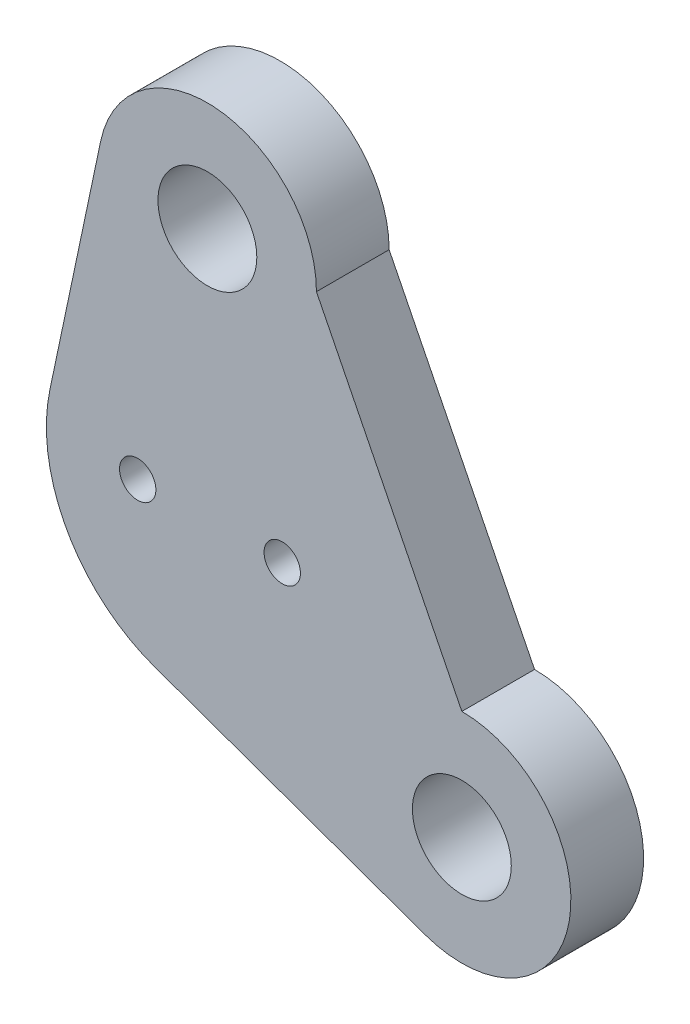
ISO-10303-21;
HEADER;
FILE_DESCRIPTION(('STEP AP214'),'2;1');
FILE_NAME('part.step','',(''),(''),'','','');
FILE_SCHEMA(('AUTOMOTIVE_DESIGN { 1 0 10303 214 1 1 1 1 }'));
ENDSEC;
DATA;
#1=APPLICATION_CONTEXT('core data for automotive mechanical design processes');
#2=APPLICATION_PROTOCOL_DEFINITION('international standard','automotive_design',2000,#1);
#3=PRODUCT_CONTEXT('',#1,'mechanical');
#4=PRODUCT('Part','Part','',(#3));
#5=PRODUCT_RELATED_PRODUCT_CATEGORY('part','',(#4));
#6=PRODUCT_DEFINITION_FORMATION('','',#4);
#7=PRODUCT_DEFINITION_CONTEXT('part definition',#1,'design');
#8=PRODUCT_DEFINITION('design','',#6,#7);
#9=PRODUCT_DEFINITION_SHAPE('','',#8);
#10=(LENGTH_UNIT() NAMED_UNIT(*) SI_UNIT(.MILLI.,.METRE.));
#11=(NAMED_UNIT(*) PLANE_ANGLE_UNIT() SI_UNIT($,.RADIAN.));
#12=(NAMED_UNIT(*) SI_UNIT($,.STERADIAN.) SOLID_ANGLE_UNIT());
#13=UNCERTAINTY_MEASURE_WITH_UNIT(LENGTH_MEASURE(1.E-05),#10,'distance_accuracy_value','');
#14=(GEOMETRIC_REPRESENTATION_CONTEXT(3) GLOBAL_UNCERTAINTY_ASSIGNED_CONTEXT((#13)) GLOBAL_UNIT_ASSIGNED_CONTEXT((#10,
#11,#12)) REPRESENTATION_CONTEXT('',''));
#15=CARTESIAN_POINT('',(0.,0.,0.));
#16=DIRECTION('',(0.,0.,1.));
#17=DIRECTION('',(1.,0.,0.));
#18=AXIS2_PLACEMENT_3D('',#15,#16,#17);
#19=CARTESIAN_POINT('',(-35.56,2.53999999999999,2.54));
#20=DIRECTION('',(0.,0.,-1.));
#21=DIRECTION('',(-1.,0.,0.));
#22=AXIS2_PLACEMENT_3D('',#19,#20,#21);
#23=CYLINDRICAL_SURFACE('',#22,3.81000000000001);
#24=CARTESIAN_POINT('',(-35.56,2.53999999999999,0.));
#25=DIRECTION('',(0.,0.,1.));
#26=DIRECTION('',(1.,0.,0.));
#27=AXIS2_PLACEMENT_3D('',#24,#25,#26);
#28=CIRCLE('',#27,3.81000000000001);
#29=CARTESIAN_POINT('',(-31.75,2.53999999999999,0.));
#30=VERTEX_POINT('',#29);
#31=CARTESIAN_POINT('',(-39.2879053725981,3.32665210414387,0.));
#32=VERTEX_POINT('',#31);
#33=EDGE_CURVE('E120',#30,#32,#28,.T.);
#34=ORIENTED_EDGE('',*,*,#33,.T.);
#35=DIRECTION('',(0.,0.,-1.));
#36=VECTOR('',#35,1.);
#37=CARTESIAN_POINT('',(-39.2879053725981,3.32665210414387,2.54));
#38=LINE('',#37,#36);
#39=CARTESIAN_POINT('',(-39.2879053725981,3.32665210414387,2.54));
#40=VERTEX_POINT('',#39);
#41=EDGE_CURVE('E11',#40,#32,#38,.T.);
#42=ORIENTED_EDGE('',*,*,#41,.F.);
#43=CARTESIAN_POINT('',(-35.56,2.53999999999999,2.54));
#44=DIRECTION('',(0.,0.,1.));
#45=DIRECTION('',(1.,0.,0.));
#46=AXIS2_PLACEMENT_3D('',#43,#44,#45);
#47=CIRCLE('',#46,3.81000000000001);
#48=CARTESIAN_POINT('',(-31.75,2.53999999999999,2.54));
#49=VERTEX_POINT('',#48);
#50=EDGE_CURVE('E131',#49,#40,#47,.T.);
#51=ORIENTED_EDGE('',*,*,#50,.F.);
#52=DIRECTION('',(0.,0.,-1.));
#53=VECTOR('',#52,1.);
#54=CARTESIAN_POINT('',(-31.75,2.53999999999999,2.54));
#55=LINE('',#54,#53);
#56=EDGE_CURVE('E116',#49,#30,#55,.T.);
#57=ORIENTED_EDGE('',*,*,#56,.T.);
#58=EDGE_LOOP('',(#34,#42,#51,#57));
#59=FACE_BOUND('',#58,.T.);
#60=ADVANCED_FACE('F35',(#59),#23,.T.);
#61=CARTESIAN_POINT('',(-39.2879053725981,3.32665210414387,2.54));
#62=DIRECTION('',(0.978452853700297,-0.206470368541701,0.));
#63=DIRECTION('',(0.206470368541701,0.978452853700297,0.));
#64=AXIS2_PLACEMENT_3D('',#61,#62,#63);
#65=PLANE('',#64);
#66=DIRECTION('',(-0.206470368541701,-0.978452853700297,0.));
#67=VECTOR('',#66,1.);
#68=CARTESIAN_POINT('',(-39.2879053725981,3.32665210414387,0.));
#69=LINE('',#68,#67);
#70=CARTESIAN_POINT('',(-41.0618580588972,-5.08002184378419,0.));
#71=VERTEX_POINT('',#70);
#72=EDGE_CURVE('E123',#32,#71,#69,.T.);
#73=ORIENTED_EDGE('',*,*,#72,.T.);
#74=DIRECTION('',(0.,0.,-1.));
#75=VECTOR('',#74,1.);
#76=CARTESIAN_POINT('',(-41.0618580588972,-5.08002184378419,2.54));
#77=LINE('',#76,#75);
#78=CARTESIAN_POINT('',(-41.0618580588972,-5.08002184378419,2.54));
#79=VERTEX_POINT('',#78);
#80=EDGE_CURVE('E44',#79,#71,#77,.T.);
#81=ORIENTED_EDGE('',*,*,#80,.F.);
#82=DIRECTION('',(-0.206470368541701,-0.978452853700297,0.));
#83=VECTOR('',#82,1.);
#84=CARTESIAN_POINT('',(-39.2879053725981,3.32665210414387,2.54));
#85=LINE('',#84,#83);
#86=EDGE_CURVE('E89',#40,#79,#85,.T.);
#87=ORIENTED_EDGE('',*,*,#86,.F.);
#88=ORIENTED_EDGE('',*,*,#41,.T.);
#89=EDGE_LOOP('',(#73,#81,#87,#88));
#90=FACE_BOUND('',#89,.T.);
#91=ADVANCED_FACE('F157',(#90),#65,.F.);
#92=CARTESIAN_POINT('',(-35.47,-6.26000000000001,2.54));
#93=DIRECTION('',(0.,0.,-1.));
#94=DIRECTION('',(-1.,0.,0.));
#95=AXIS2_PLACEMENT_3D('',#92,#93,#94);
#96=CYLINDRICAL_SURFACE('',#95,5.715);
#97=CARTESIAN_POINT('',(-35.47,-6.26000000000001,0.));
#98=DIRECTION('',(0.,0.,1.));
#99=DIRECTION('',(1.,0.,0.));
#100=AXIS2_PLACEMENT_3D('',#97,#98,#99);
#101=CIRCLE('',#100,5.715);
#102=CARTESIAN_POINT('',(-37.3943338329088,-11.6412790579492,0.));
#103=VERTEX_POINT('',#102);
#104=EDGE_CURVE('E126',#71,#103,#101,.T.);
#105=ORIENTED_EDGE('',*,*,#104,.T.);
#106=DIRECTION('',(0.,0.,-1.));
#107=VECTOR('',#106,1.);
#108=CARTESIAN_POINT('',(-37.3943338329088,-11.6412790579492,2.54));
#109=LINE('',#108,#107);
#110=CARTESIAN_POINT('',(-37.3943338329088,-11.6412790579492,2.54));
#111=VERTEX_POINT('',#110);
#112=EDGE_CURVE('E111',#111,#103,#109,.T.);
#113=ORIENTED_EDGE('',*,*,#112,.F.);
#114=CARTESIAN_POINT('',(-35.47,-6.26000000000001,2.54));
#115=DIRECTION('',(0.,0.,1.));
#116=DIRECTION('',(1.,0.,0.));
#117=AXIS2_PLACEMENT_3D('',#114,#115,#116);
#118=CIRCLE('',#117,5.715);
#119=EDGE_CURVE('E102',#79,#111,#118,.T.);
#120=ORIENTED_EDGE('',*,*,#119,.F.);
#121=ORIENTED_EDGE('',*,*,#80,.T.);
#122=EDGE_LOOP('',(#105,#113,#120,#121));
#123=FACE_BOUND('',#122,.T.);
#124=ADVANCED_FACE('F138',(#123),#96,.T.);
#125=CARTESIAN_POINT('',(-37.3943338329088,-11.6412790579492,2.54));
#126=DIRECTION('',(0.336716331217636,0.941606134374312,0.));
#127=DIRECTION('',(-0.941606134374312,0.336716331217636,0.));
#128=AXIS2_PLACEMENT_3D('',#125,#126,#127);
#129=PLANE('',#128);
#130=DIRECTION('',(0.941606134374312,-0.336716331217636,0.));
#131=VECTOR('',#130,1.);
#132=CARTESIAN_POINT('',(-37.3943338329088,-11.6412790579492,0.));
#133=LINE('',#132,#131);
#134=CARTESIAN_POINT('',(-27.9528892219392,-15.0175193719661,0.));
#135=VERTEX_POINT('',#134);
#136=EDGE_CURVE('E110',#103,#135,#133,.T.);
#137=ORIENTED_EDGE('',*,*,#136,.T.);
#138=DIRECTION('',(0.,0.,-1.));
#139=VECTOR('',#138,1.);
#140=CARTESIAN_POINT('',(-27.9528892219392,-15.0175193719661,2.54));
#141=LINE('',#140,#139);
#142=CARTESIAN_POINT('',(-27.9528892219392,-15.0175193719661,2.54));
#143=VERTEX_POINT('',#142);
#144=EDGE_CURVE('E107',#143,#135,#141,.T.);
#145=ORIENTED_EDGE('',*,*,#144,.F.);
#146=DIRECTION('',(0.941606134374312,-0.336716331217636,0.));
#147=VECTOR('',#146,1.);
#148=CARTESIAN_POINT('',(-37.3943338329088,-11.6412790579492,2.54));
#149=LINE('',#148,#147);
#150=EDGE_CURVE('E96',#111,#143,#149,.T.);
#151=ORIENTED_EDGE('',*,*,#150,.F.);
#152=ORIENTED_EDGE('',*,*,#112,.T.);
#153=EDGE_LOOP('',(#137,#145,#151,#152));
#154=FACE_BOUND('',#153,.T.);
#155=ADVANCED_FACE('F108',(#154),#129,.F.);
#156=CARTESIAN_POINT('',(-26.67,-11.43,2.54));
#157=DIRECTION('',(0.,0.,-1.));
#158=DIRECTION('',(-1.,0.,0.));
#159=AXIS2_PLACEMENT_3D('',#156,#157,#158);
#160=CYLINDRICAL_SURFACE('',#159,3.81);
#161=CARTESIAN_POINT('',(-26.67,-11.43,0.));
#162=DIRECTION('',(0.,0.,1.));
#163=DIRECTION('',(1.,0.,0.));
#164=AXIS2_PLACEMENT_3D('',#161,#162,#163);
#165=CIRCLE('',#164,3.81);
#166=CARTESIAN_POINT('',(-26.67,-7.62000000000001,0.));
#167=VERTEX_POINT('',#166);
#168=EDGE_CURVE('E75',#135,#167,#165,.T.);
#169=ORIENTED_EDGE('',*,*,#168,.T.);
#170=DIRECTION('',(0.,0.,-1.));
#171=VECTOR('',#170,1.);
#172=CARTESIAN_POINT('',(-26.67,-7.62000000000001,2.54));
#173=LINE('',#172,#171);
#174=CARTESIAN_POINT('',(-26.67,-7.62000000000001,2.54));
#175=VERTEX_POINT('',#174);
#176=EDGE_CURVE('E112',#175,#167,#173,.T.);
#177=ORIENTED_EDGE('',*,*,#176,.F.);
#178=CARTESIAN_POINT('',(-26.67,-11.43,2.54));
#179=DIRECTION('',(0.,0.,1.));
#180=DIRECTION('',(1.,0.,0.));
#181=AXIS2_PLACEMENT_3D('',#178,#179,#180);
#182=CIRCLE('',#181,3.81);
#183=EDGE_CURVE('E100',#143,#175,#182,.T.);
#184=ORIENTED_EDGE('',*,*,#183,.F.);
#185=ORIENTED_EDGE('',*,*,#144,.T.);
#186=EDGE_LOOP('',(#169,#177,#184,#185));
#187=FACE_BOUND('',#186,.T.);
#188=ADVANCED_FACE('F114',(#187),#160,.T.);
#189=CARTESIAN_POINT('',(-31.75,2.53999999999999,2.54));
#190=DIRECTION('',(-0.894427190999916,-0.447213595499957,0.));
#191=DIRECTION('',(0.447213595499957,-0.894427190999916,0.));
#192=AXIS2_PLACEMENT_3D('',#189,#190,#191);
#193=PLANE('',#192);
#194=DIRECTION('',(-0.447213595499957,0.894427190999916,0.));
#195=VECTOR('',#194,1.);
#196=CARTESIAN_POINT('',(-31.75,2.53999999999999,0.));
#197=LINE('',#196,#195);
#198=EDGE_CURVE('E81',#167,#30,#197,.T.);
#199=ORIENTED_EDGE('',*,*,#198,.T.);
#200=ORIENTED_EDGE('',*,*,#56,.F.);
#201=DIRECTION('',(-0.447213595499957,0.894427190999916,0.));
#202=VECTOR('',#201,1.);
#203=CARTESIAN_POINT('',(-31.75,2.53999999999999,2.54));
#204=LINE('',#203,#202);
#205=EDGE_CURVE('E52',#175,#49,#204,.T.);
#206=ORIENTED_EDGE('',*,*,#205,.F.);
#207=ORIENTED_EDGE('',*,*,#176,.T.);
#208=EDGE_LOOP('',(#199,#200,#206,#207));
#209=FACE_BOUND('',#208,.T.);
#210=ADVANCED_FACE('F145',(#209),#193,.F.);
#211=CARTESIAN_POINT('',(-35.56,2.53999999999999,2.54));
#212=DIRECTION('',(0.,0.,1.));
#213=DIRECTION('',(1.,0.,0.));
#214=AXIS2_PLACEMENT_3D('',#211,#212,#213);
#215=PLANE('',#214);
#216=CARTESIAN_POINT('',(-37.995,-6.26000000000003,2.54));
#217=DIRECTION('',(0.,0.,1.));
#218=DIRECTION('',(1.,0.,0.));
#219=AXIS2_PLACEMENT_3D('',#216,#217,#218);
#220=CIRCLE('',#219,0.634999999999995);
#221=CARTESIAN_POINT('',(-37.36,-6.26000000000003,2.54));
#222=VERTEX_POINT('',#221);
#223=EDGE_CURVE('E243',#222,#222,#220,.T.);
#224=ORIENTED_EDGE('',*,*,#223,.F.);
#225=EDGE_LOOP('',(#224));
#226=FACE_BOUND('',#225,.T.);
#227=CARTESIAN_POINT('',(-32.945,-6.26000000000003,2.54));
#228=DIRECTION('',(0.,0.,1.));
#229=DIRECTION('',(1.,0.,0.));
#230=AXIS2_PLACEMENT_3D('',#227,#228,#229);
#231=CIRCLE('',#230,0.634999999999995);
#232=CARTESIAN_POINT('',(-32.31,-6.26000000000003,2.54));
#233=VERTEX_POINT('',#232);
#234=EDGE_CURVE('E245',#233,#233,#231,.T.);
#235=ORIENTED_EDGE('',*,*,#234,.F.);
#236=EDGE_LOOP('',(#235));
#237=FACE_BOUND('',#236,.T.);
#238=CARTESIAN_POINT('',(-26.67,-11.43,2.54));
#239=DIRECTION('',(0.,0.,1.));
#240=DIRECTION('',(1.,0.,0.));
#241=AXIS2_PLACEMENT_3D('',#238,#239,#240);
#242=CIRCLE('',#241,1.7272);
#243=CARTESIAN_POINT('',(-24.9428,-11.43,2.54));
#244=VERTEX_POINT('',#243);
#245=EDGE_CURVE('E251',#244,#244,#242,.T.);
#246=ORIENTED_EDGE('',*,*,#245,.F.);
#247=EDGE_LOOP('',(#246));
#248=FACE_BOUND('',#247,.T.);
#249=CARTESIAN_POINT('',(-35.56,2.53999999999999,2.54));
#250=DIRECTION('',(0.,0.,1.));
#251=DIRECTION('',(1.,0.,0.));
#252=AXIS2_PLACEMENT_3D('',#249,#250,#251);
#253=CIRCLE('',#252,1.7272);
#254=CARTESIAN_POINT('',(-33.8328,2.53999999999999,2.54));
#255=VERTEX_POINT('',#254);
#256=EDGE_CURVE('E256',#255,#255,#253,.T.);
#257=ORIENTED_EDGE('',*,*,#256,.F.);
#258=EDGE_LOOP('',(#257));
#259=FACE_BOUND('',#258,.T.);
#260=ORIENTED_EDGE('',*,*,#50,.T.);
#261=ORIENTED_EDGE('',*,*,#86,.T.);
#262=ORIENTED_EDGE('',*,*,#119,.T.);
#263=ORIENTED_EDGE('',*,*,#150,.T.);
#264=ORIENTED_EDGE('',*,*,#183,.T.);
#265=ORIENTED_EDGE('',*,*,#205,.T.);
#266=EDGE_LOOP('',(#260,#261,#262,#263,#264,#265));
#267=FACE_BOUND('',#266,.T.);
#268=ADVANCED_FACE('F98',(#226,#237,#248,#259,#267),#215,.T.);
#269=CARTESIAN_POINT('',(-35.56,2.53999999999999,0.));
#270=DIRECTION('',(0.,0.,1.));
#271=DIRECTION('',(1.,0.,0.));
#272=AXIS2_PLACEMENT_3D('',#269,#270,#271);
#273=PLANE('',#272);
#274=CARTESIAN_POINT('',(-37.995,-6.26000000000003,0.));
#275=DIRECTION('',(0.,0.,1.));
#276=DIRECTION('',(1.,0.,0.));
#277=AXIS2_PLACEMENT_3D('',#274,#275,#276);
#278=CIRCLE('',#277,0.634999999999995);
#279=CARTESIAN_POINT('',(-37.36,-6.26000000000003,0.));
#280=VERTEX_POINT('',#279);
#281=EDGE_CURVE('E240',#280,#280,#278,.T.);
#282=ORIENTED_EDGE('',*,*,#281,.T.);
#283=EDGE_LOOP('',(#282));
#284=FACE_BOUND('',#283,.T.);
#285=CARTESIAN_POINT('',(-32.945,-6.26000000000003,0.));
#286=DIRECTION('',(0.,0.,1.));
#287=DIRECTION('',(1.,0.,0.));
#288=AXIS2_PLACEMENT_3D('',#285,#286,#287);
#289=CIRCLE('',#288,0.634999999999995);
#290=CARTESIAN_POINT('',(-32.31,-6.26000000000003,0.));
#291=VERTEX_POINT('',#290);
#292=EDGE_CURVE('E248',#291,#291,#289,.T.);
#293=ORIENTED_EDGE('',*,*,#292,.T.);
#294=EDGE_LOOP('',(#293));
#295=FACE_BOUND('',#294,.T.);
#296=CARTESIAN_POINT('',(-26.67,-11.43,0.));
#297=DIRECTION('',(0.,0.,1.));
#298=DIRECTION('',(1.,0.,0.));
#299=AXIS2_PLACEMENT_3D('',#296,#297,#298);
#300=CIRCLE('',#299,1.7272);
#301=CARTESIAN_POINT('',(-24.9428,-11.43,0.));
#302=VERTEX_POINT('',#301);
#303=EDGE_CURVE('E38',#302,#302,#300,.T.);
#304=ORIENTED_EDGE('',*,*,#303,.T.);
#305=EDGE_LOOP('',(#304));
#306=FACE_BOUND('',#305,.T.);
#307=CARTESIAN_POINT('',(-35.56,2.53999999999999,0.));
#308=DIRECTION('',(0.,0.,1.));
#309=DIRECTION('',(1.,0.,0.));
#310=AXIS2_PLACEMENT_3D('',#307,#308,#309);
#311=CIRCLE('',#310,1.7272);
#312=CARTESIAN_POINT('',(-33.8328,2.53999999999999,0.));
#313=VERTEX_POINT('',#312);
#314=EDGE_CURVE('E124',#313,#313,#311,.T.);
#315=ORIENTED_EDGE('',*,*,#314,.T.);
#316=EDGE_LOOP('',(#315));
#317=FACE_BOUND('',#316,.T.);
#318=ORIENTED_EDGE('',*,*,#33,.F.);
#319=ORIENTED_EDGE('',*,*,#198,.F.);
#320=ORIENTED_EDGE('',*,*,#168,.F.);
#321=ORIENTED_EDGE('',*,*,#136,.F.);
#322=ORIENTED_EDGE('',*,*,#104,.F.);
#323=ORIENTED_EDGE('',*,*,#72,.F.);
#324=EDGE_LOOP('',(#318,#319,#320,#321,#322,#323));
#325=FACE_BOUND('',#324,.T.);
#326=ADVANCED_FACE('F141',(#284,#295,#306,#317,#325),#273,.F.);
#327=CARTESIAN_POINT('',(-35.56,2.53999999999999,2.54));
#328=DIRECTION('',(0.,0.,1.));
#329=DIRECTION('',(1.,0.,0.));
#330=AXIS2_PLACEMENT_3D('',#327,#328,#329);
#331=CYLINDRICAL_SURFACE('',#330,1.7272);
#332=ORIENTED_EDGE('',*,*,#256,.T.);
#333=EDGE_LOOP('',(#332));
#334=FACE_BOUND('',#333,.T.);
#335=ORIENTED_EDGE('',*,*,#314,.F.);
#336=EDGE_LOOP('',(#335));
#337=FACE_BOUND('',#336,.T.);
#338=ADVANCED_FACE('F185',(#334,#337),#331,.F.);
#339=CARTESIAN_POINT('',(-26.67,-11.43,2.54));
#340=DIRECTION('',(0.,0.,1.));
#341=DIRECTION('',(1.,0.,0.));
#342=AXIS2_PLACEMENT_3D('',#339,#340,#341);
#343=CYLINDRICAL_SURFACE('',#342,1.7272);
#344=ORIENTED_EDGE('',*,*,#245,.T.);
#345=EDGE_LOOP('',(#344));
#346=FACE_BOUND('',#345,.T.);
#347=ORIENTED_EDGE('',*,*,#303,.F.);
#348=EDGE_LOOP('',(#347));
#349=FACE_BOUND('',#348,.T.);
#350=ADVANCED_FACE('F190',(#346,#349),#343,.F.);
#351=CARTESIAN_POINT('',(-32.945,-6.26000000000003,0.));
#352=DIRECTION('',(0.,0.,1.));
#353=DIRECTION('',(1.,0.,0.));
#354=AXIS2_PLACEMENT_3D('',#351,#352,#353);
#355=CYLINDRICAL_SURFACE('',#354,0.634999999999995);
#356=ORIENTED_EDGE('',*,*,#292,.F.);
#357=EDGE_LOOP('',(#356));
#358=FACE_BOUND('',#357,.T.);
#359=ORIENTED_EDGE('',*,*,#234,.T.);
#360=EDGE_LOOP('',(#359));
#361=FACE_BOUND('',#360,.T.);
#362=ADVANCED_FACE('F202',(#358,#361),#355,.F.);
#363=CARTESIAN_POINT('',(-37.995,-6.26000000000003,0.));
#364=DIRECTION('',(0.,0.,1.));
#365=DIRECTION('',(1.,0.,0.));
#366=AXIS2_PLACEMENT_3D('',#363,#364,#365);
#367=CYLINDRICAL_SURFACE('',#366,0.634999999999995);
#368=ORIENTED_EDGE('',*,*,#281,.F.);
#369=EDGE_LOOP('',(#368));
#370=FACE_BOUND('',#369,.T.);
#371=ORIENTED_EDGE('',*,*,#223,.T.);
#372=EDGE_LOOP('',(#371));
#373=FACE_BOUND('',#372,.T.);
#374=ADVANCED_FACE('F223',(#370,#373),#367,.F.);
#375=CLOSED_SHELL('',(#60,#91,#124,#155,#188,#210,#268,#326,#338,#350,#362,#374));
#376=MANIFOLD_SOLID_BREP('B2',#375);
#377=ADVANCED_BREP_SHAPE_REPRESENTATION('',(#18,#376),#14);
#378=SHAPE_DEFINITION_REPRESENTATION(#9,#377);
ENDSEC;
END-ISO-10303-21;
